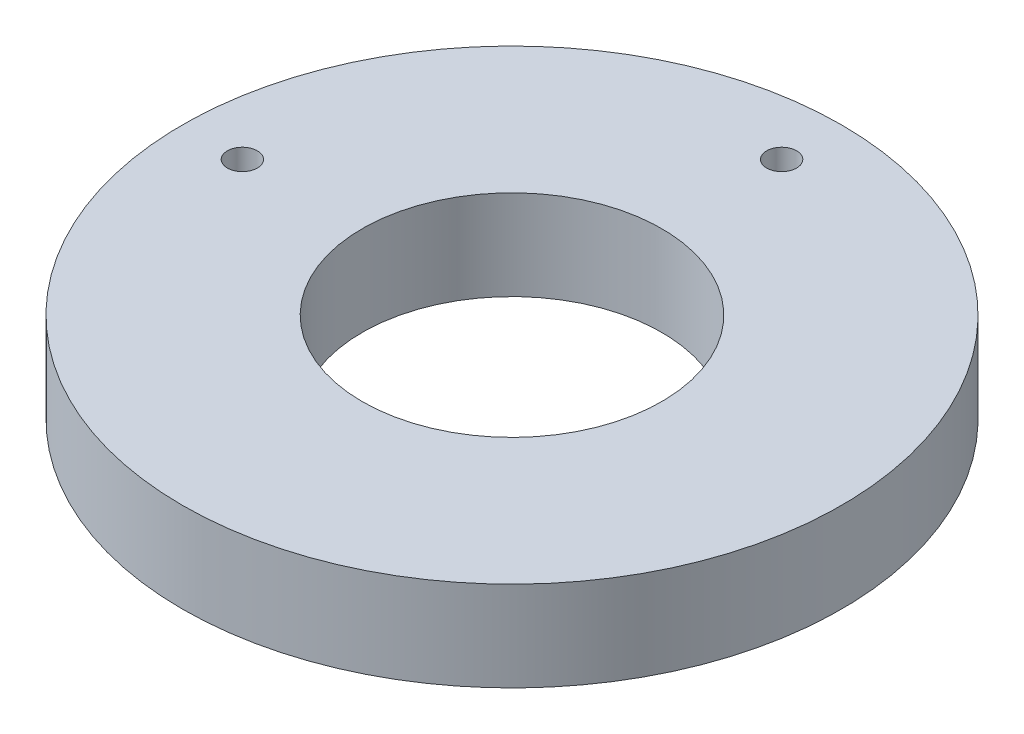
ISO-10303-21;
HEADER;
FILE_DESCRIPTION(('STEP AP214'),'2;1');
FILE_NAME('part.step','',(''),(''),'','','');
FILE_SCHEMA(('AUTOMOTIVE_DESIGN { 1 0 10303 214 1 1 1 1 }'));
ENDSEC;
DATA;
#1=APPLICATION_CONTEXT('core data for automotive mechanical design processes');
#2=APPLICATION_PROTOCOL_DEFINITION('international standard','automotive_design',2000,#1);
#3=PRODUCT_CONTEXT('',#1,'mechanical');
#4=PRODUCT('Part','Part','',(#3));
#5=PRODUCT_RELATED_PRODUCT_CATEGORY('part','',(#4));
#6=PRODUCT_DEFINITION_FORMATION('','',#4);
#7=PRODUCT_DEFINITION_CONTEXT('part definition',#1,'design');
#8=PRODUCT_DEFINITION('design','',#6,#7);
#9=PRODUCT_DEFINITION_SHAPE('','',#8);
#10=(LENGTH_UNIT() NAMED_UNIT(*) SI_UNIT(.MILLI.,.METRE.));
#11=(NAMED_UNIT(*) PLANE_ANGLE_UNIT() SI_UNIT($,.RADIAN.));
#12=(NAMED_UNIT(*) SI_UNIT($,.STERADIAN.) SOLID_ANGLE_UNIT());
#13=UNCERTAINTY_MEASURE_WITH_UNIT(LENGTH_MEASURE(1.E-05),#10,'distance_accuracy_value','');
#14=(GEOMETRIC_REPRESENTATION_CONTEXT(3) GLOBAL_UNCERTAINTY_ASSIGNED_CONTEXT((#13)) GLOBAL_UNIT_ASSIGNED_CONTEXT((#10,
#11,#12)) REPRESENTATION_CONTEXT('',''));
#15=CARTESIAN_POINT('',(0.,0.,0.));
#16=DIRECTION('',(0.,0.,1.));
#17=DIRECTION('',(1.,0.,0.));
#18=AXIS2_PLACEMENT_3D('',#15,#16,#17);
#19=CARTESIAN_POINT('',(0.,3.,0.));
#20=DIRECTION('',(0.,1.,0.));
#21=DIRECTION('',(0.,0.,1.));
#22=AXIS2_PLACEMENT_3D('',#19,#20,#21);
#23=PLANE('',#22);
#24=CARTESIAN_POINT('',(-9.,3.,0.));
#25=DIRECTION('',(0.,1.,0.));
#26=DIRECTION('',(0.,0.,1.));
#27=AXIS2_PLACEMENT_3D('',#24,#25,#26);
#28=CIRCLE('',#27,0.500000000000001);
#29=CARTESIAN_POINT('',(-9.,3.,0.500000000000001));
#30=VERTEX_POINT('',#29);
#31=EDGE_CURVE('E46',#30,#30,#28,.T.);
#32=ORIENTED_EDGE('',*,*,#31,.F.);
#33=EDGE_LOOP('',(#32));
#34=FACE_BOUND('',#33,.T.);
#35=CARTESIAN_POINT('',(0.,3.,0.));
#36=DIRECTION('',(0.,1.,0.));
#37=DIRECTION('',(0.,0.,1.));
#38=AXIS2_PLACEMENT_3D('',#35,#36,#37);
#39=CIRCLE('',#38,11.);
#40=CARTESIAN_POINT('',(0.,3.,11.));
#41=VERTEX_POINT('',#40);
#42=EDGE_CURVE('E10',#41,#41,#39,.T.);
#43=ORIENTED_EDGE('',*,*,#42,.T.);
#44=EDGE_LOOP('',(#43));
#45=FACE_BOUND('',#44,.T.);
#46=CARTESIAN_POINT('',(0.,3.,0.));
#47=DIRECTION('',(0.,1.,0.));
#48=DIRECTION('',(0.,0.,1.));
#49=AXIS2_PLACEMENT_3D('',#46,#47,#48);
#50=CIRCLE('',#49,5.);
#51=CARTESIAN_POINT('',(0.,3.,5.));
#52=VERTEX_POINT('',#51);
#53=EDGE_CURVE('E41',#52,#52,#50,.T.);
#54=ORIENTED_EDGE('',*,*,#53,.F.);
#55=EDGE_LOOP('',(#54));
#56=FACE_BOUND('',#55,.T.);
#57=CARTESIAN_POINT('',(0.,3.,-9.));
#58=DIRECTION('',(0.,1.,0.));
#59=DIRECTION('',(0.,0.,1.));
#60=AXIS2_PLACEMENT_3D('',#57,#58,#59);
#61=CIRCLE('',#60,0.5);
#62=CARTESIAN_POINT('',(0.,3.,-8.5));
#63=VERTEX_POINT('',#62);
#64=EDGE_CURVE('E54',#63,#63,#61,.T.);
#65=ORIENTED_EDGE('',*,*,#64,.F.);
#66=EDGE_LOOP('',(#65));
#67=FACE_BOUND('',#66,.T.);
#68=ADVANCED_FACE('F30',(#34,#45,#56,#67),#23,.T.);
#69=CARTESIAN_POINT('',(0.,0.,0.));
#70=DIRECTION('',(0.,1.,0.));
#71=DIRECTION('',(0.,0.,1.));
#72=AXIS2_PLACEMENT_3D('',#69,#70,#71);
#73=PLANE('',#72);
#74=CARTESIAN_POINT('',(-9.,0.,0.));
#75=DIRECTION('',(0.,1.,0.));
#76=DIRECTION('',(0.,0.,1.));
#77=AXIS2_PLACEMENT_3D('',#74,#75,#76);
#78=CIRCLE('',#77,0.500000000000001);
#79=CARTESIAN_POINT('',(-9.,0.,0.500000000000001));
#80=VERTEX_POINT('',#79);
#81=EDGE_CURVE('E51',#80,#80,#78,.T.);
#82=ORIENTED_EDGE('',*,*,#81,.T.);
#83=EDGE_LOOP('',(#82));
#84=FACE_BOUND('',#83,.T.);
#85=CARTESIAN_POINT('',(0.,0.,0.));
#86=DIRECTION('',(0.,1.,0.));
#87=DIRECTION('',(0.,0.,1.));
#88=AXIS2_PLACEMENT_3D('',#85,#86,#87);
#89=CIRCLE('',#88,11.);
#90=CARTESIAN_POINT('',(0.,0.,11.));
#91=VERTEX_POINT('',#90);
#92=EDGE_CURVE('E34',#91,#91,#89,.T.);
#93=ORIENTED_EDGE('',*,*,#92,.F.);
#94=EDGE_LOOP('',(#93));
#95=FACE_BOUND('',#94,.T.);
#96=CARTESIAN_POINT('',(0.,0.,0.));
#97=DIRECTION('',(0.,1.,0.));
#98=DIRECTION('',(0.,0.,1.));
#99=AXIS2_PLACEMENT_3D('',#96,#97,#98);
#100=CIRCLE('',#99,5.);
#101=CARTESIAN_POINT('',(0.,0.,5.));
#102=VERTEX_POINT('',#101);
#103=EDGE_CURVE('E43',#102,#102,#100,.T.);
#104=ORIENTED_EDGE('',*,*,#103,.T.);
#105=EDGE_LOOP('',(#104));
#106=FACE_BOUND('',#105,.T.);
#107=CARTESIAN_POINT('',(0.,0.,-9.));
#108=DIRECTION('',(0.,1.,0.));
#109=DIRECTION('',(0.,0.,1.));
#110=AXIS2_PLACEMENT_3D('',#107,#108,#109);
#111=CIRCLE('',#110,0.5);
#112=CARTESIAN_POINT('',(0.,0.,-8.5));
#113=VERTEX_POINT('',#112);
#114=EDGE_CURVE('E57',#113,#113,#111,.T.);
#115=ORIENTED_EDGE('',*,*,#114,.T.);
#116=EDGE_LOOP('',(#115));
#117=FACE_BOUND('',#116,.T.);
#118=ADVANCED_FACE('F61',(#84,#95,#106,#117),#73,.F.);
#119=CARTESIAN_POINT('',(0.,3.,0.));
#120=DIRECTION('',(0.,-1.,0.));
#121=DIRECTION('',(0.,0.,-1.));
#122=AXIS2_PLACEMENT_3D('',#119,#120,#121);
#123=CYLINDRICAL_SURFACE('',#122,11.);
#124=ORIENTED_EDGE('',*,*,#42,.F.);
#125=EDGE_LOOP('',(#124));
#126=FACE_BOUND('',#125,.T.);
#127=ORIENTED_EDGE('',*,*,#92,.T.);
#128=EDGE_LOOP('',(#127));
#129=FACE_BOUND('',#128,.T.);
#130=ADVANCED_FACE('F32',(#126,#129),#123,.T.);
#131=CARTESIAN_POINT('',(0.,3.,0.));
#132=DIRECTION('',(0.,-1.,0.));
#133=DIRECTION('',(0.,0.,-1.));
#134=AXIS2_PLACEMENT_3D('',#131,#132,#133);
#135=CYLINDRICAL_SURFACE('',#134,5.);
#136=ORIENTED_EDGE('',*,*,#53,.T.);
#137=EDGE_LOOP('',(#136));
#138=FACE_BOUND('',#137,.T.);
#139=ORIENTED_EDGE('',*,*,#103,.F.);
#140=EDGE_LOOP('',(#139));
#141=FACE_BOUND('',#140,.T.);
#142=ADVANCED_FACE('F71',(#138,#141),#135,.F.);
#143=CARTESIAN_POINT('',(-9.,3.001,0.));
#144=DIRECTION('',(0.,-1.,0.));
#145=DIRECTION('',(0.,0.,-1.));
#146=AXIS2_PLACEMENT_3D('',#143,#144,#145);
#147=CYLINDRICAL_SURFACE('',#146,0.500000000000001);
#148=ORIENTED_EDGE('',*,*,#31,.T.);
#149=EDGE_LOOP('',(#148));
#150=FACE_BOUND('',#149,.T.);
#151=ORIENTED_EDGE('',*,*,#81,.F.);
#152=EDGE_LOOP('',(#151));
#153=FACE_BOUND('',#152,.T.);
#154=ADVANCED_FACE('F65',(#150,#153),#147,.F.);
#155=CARTESIAN_POINT('',(0.,3.001,-9.));
#156=DIRECTION('',(0.,-1.,0.));
#157=DIRECTION('',(0.,0.,-1.));
#158=AXIS2_PLACEMENT_3D('',#155,#156,#157);
#159=CYLINDRICAL_SURFACE('',#158,0.5);
#160=ORIENTED_EDGE('',*,*,#64,.T.);
#161=EDGE_LOOP('',(#160));
#162=FACE_BOUND('',#161,.T.);
#163=ORIENTED_EDGE('',*,*,#114,.F.);
#164=EDGE_LOOP('',(#163));
#165=FACE_BOUND('',#164,.T.);
#166=ADVANCED_FACE('F63',(#162,#165),#159,.F.);
#167=CLOSED_SHELL('',(#68,#118,#130,#142,#154,#166));
#168=MANIFOLD_SOLID_BREP('B2',#167);
#169=ADVANCED_BREP_SHAPE_REPRESENTATION('',(#18,#168),#14);
#170=SHAPE_DEFINITION_REPRESENTATION(#9,#169);
ENDSEC;
END-ISO-10303-21;
